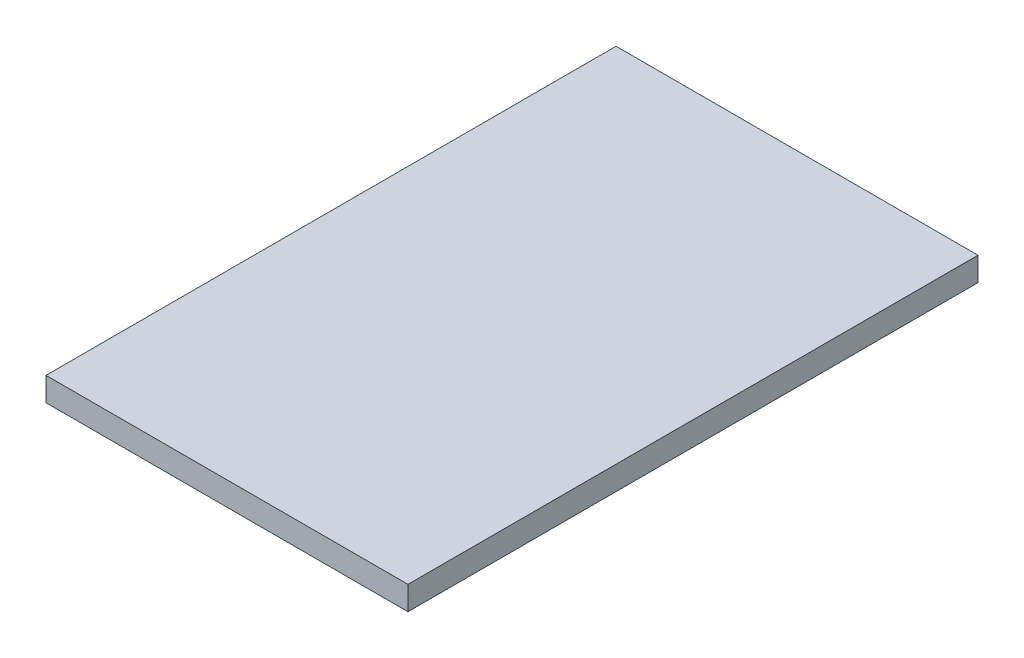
from build123d import *

# Parameters (mm, degrees)
SKETCH1_W           = 76.2
SKETCH1_H           = 120
BOSS_EXTRUDE1_DEPTH = 5


with BuildPart() as part:
    # Sketch1 → Boss-Extrude1 (new body)
    with BuildSketch(Plane(origin=(0, 0, 0), x_dir=(1, 0, 0), z_dir=(0, 1, 0))):
        Rectangle(SKETCH1_W, SKETCH1_H)
    extrude(amount=BOSS_EXTRUDE1_DEPTH)


solid = part.part
